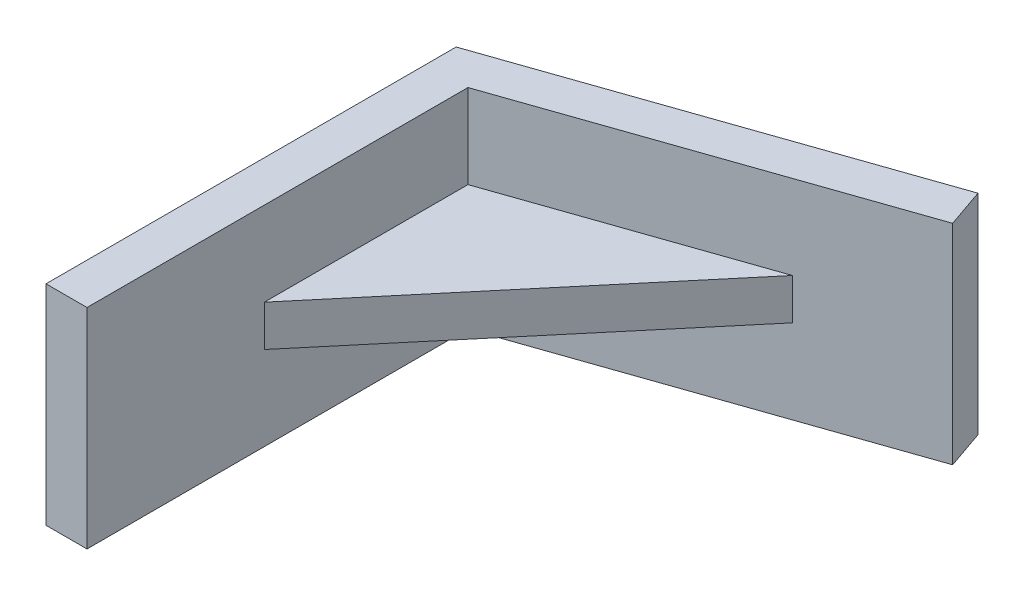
from build123d import *

# Parameters (mm, degrees)
SALIENTE_EXTRUIR1_DEPTH = 25.5
NERVIO1_REACH           = 158.84
CROQUIS2_WALL_W         = 407.058236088
CROQUIS2_WALL_H         = 10


with BuildPart() as part:
    # Croquis1 → Saliente-Extruir1 (new, symmetric)
    with BuildSketch(Plane(origin=(0, 0, 0), x_dir=(1, 0, 0), z_dir=(0, 1, 0))):
        Polygon((-5, 91.117591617), (-5, -8.882408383), (5, -8.882408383), (5, 84.000413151), (92.759052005, 114.42355118), (89.48361985, 123.871913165), align=None)
    extrude(amount=SALIENTE_EXTRUIR1_DEPTH, both=True)

    # Croquis2 wall → Nervio1 (add, up to next)
    with BuildSketch(Plane(origin=(34.368487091, 0, -69.362564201), x_dir=(0.642787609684, 0, -0.766044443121), z_dir=(-0.766044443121, 0, -0.642787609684)), mode=Mode.PRIVATE) as nervio1_sk1:
        Rectangle(CROQUIS2_WALL_W, CROQUIS2_WALL_H)
    nervio1_tool1 = extrude(nervio1_sk1.sketch, amount=NERVIO1_REACH, mode=Mode.PRIVATE) - part.part
    add(nervio1_tool1.solids().sort_by_distance((34.368487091, 0, -69.362564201))[0])


solid = part.part
